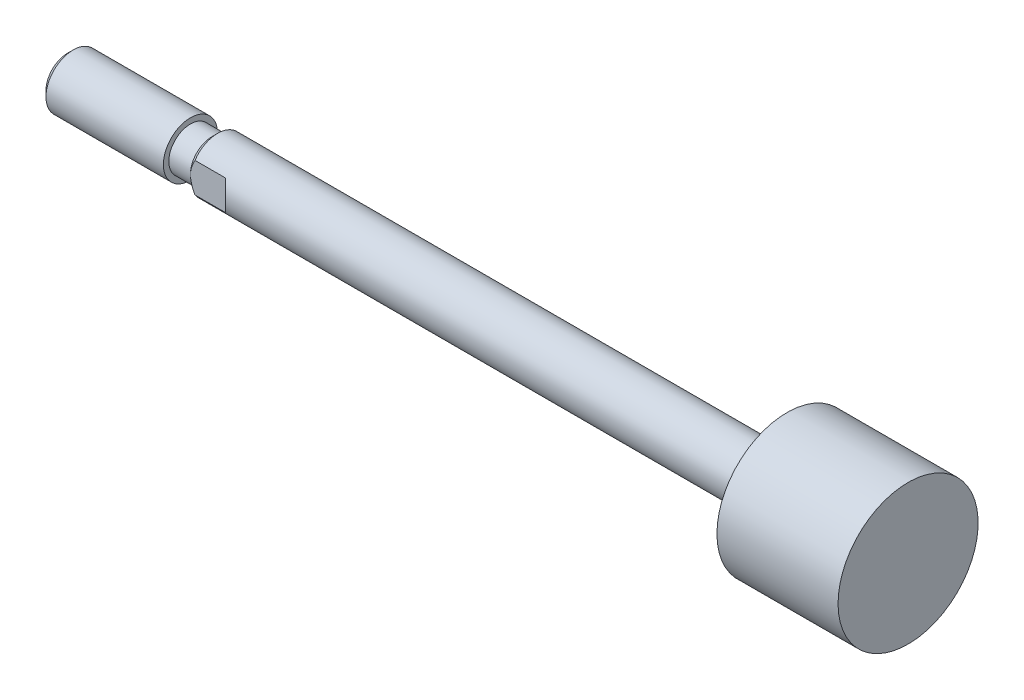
ISO-10303-21;
HEADER;
FILE_DESCRIPTION(('STEP AP214'),'2;1');
FILE_NAME('part.step','',(''),(''),'','','');
FILE_SCHEMA(('AUTOMOTIVE_DESIGN { 1 0 10303 214 1 1 1 1 }'));
ENDSEC;
DATA;
#1=APPLICATION_CONTEXT('core data for automotive mechanical design processes');
#2=APPLICATION_PROTOCOL_DEFINITION('international standard','automotive_design',2000,#1);
#3=PRODUCT_CONTEXT('',#1,'mechanical');
#4=PRODUCT('Part','Part','',(#3));
#5=PRODUCT_RELATED_PRODUCT_CATEGORY('part','',(#4));
#6=PRODUCT_DEFINITION_FORMATION('','',#4);
#7=PRODUCT_DEFINITION_CONTEXT('part definition',#1,'design');
#8=PRODUCT_DEFINITION('design','',#6,#7);
#9=PRODUCT_DEFINITION_SHAPE('','',#8);
#10=(LENGTH_UNIT() NAMED_UNIT(*) SI_UNIT(.MILLI.,.METRE.));
#11=(NAMED_UNIT(*) PLANE_ANGLE_UNIT() SI_UNIT($,.RADIAN.));
#12=(NAMED_UNIT(*) SI_UNIT($,.STERADIAN.) SOLID_ANGLE_UNIT());
#13=UNCERTAINTY_MEASURE_WITH_UNIT(LENGTH_MEASURE(1.E-05),#10,'distance_accuracy_value','');
#14=(GEOMETRIC_REPRESENTATION_CONTEXT(3) GLOBAL_UNCERTAINTY_ASSIGNED_CONTEXT((#13)) GLOBAL_UNIT_ASSIGNED_CONTEXT((#10,
#11,#12)) REPRESENTATION_CONTEXT('',''));
#15=CARTESIAN_POINT('',(0.,0.,0.));
#16=DIRECTION('',(0.,0.,1.));
#17=DIRECTION('',(1.,0.,0.));
#18=AXIS2_PLACEMENT_3D('',#15,#16,#17);
#19=CARTESIAN_POINT('',(-38.,0.,0.));
#20=DIRECTION('',(1.,0.,0.));
#21=DIRECTION('',(0.,0.,-1.));
#22=AXIS2_PLACEMENT_3D('',#19,#20,#21);
#23=PLANE('',#22);
#24=CARTESIAN_POINT('',(-38.,0.,0.));
#25=DIRECTION('',(-1.,0.,0.));
#26=DIRECTION('',(0.,0.,1.));
#27=AXIS2_PLACEMENT_3D('',#24,#25,#26);
#28=CIRCLE('',#27,2.3865);
#29=CARTESIAN_POINT('',(-38.,0.,2.3865));
#30=VERTEX_POINT('',#29);
#31=EDGE_CURVE('E60',#30,#30,#28,.T.);
#32=ORIENTED_EDGE('',*,*,#31,.T.);
#33=EDGE_LOOP('',(#32));
#34=FACE_BOUND('',#33,.T.);
#35=ADVANCED_FACE('F16',(#34),#23,.F.);
#36=CARTESIAN_POINT('',(-37.3865,0.,0.));
#37=DIRECTION('',(1.,0.,0.));
#38=DIRECTION('',(0.,0.,-1.));
#39=AXIS2_PLACEMENT_3D('',#36,#37,#38);
#40=CONICAL_SURFACE('',#39,3.,0.785398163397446);
#41=ORIENTED_EDGE('',*,*,#31,.F.);
#42=EDGE_LOOP('',(#41));
#43=FACE_BOUND('',#42,.T.);
#44=CARTESIAN_POINT('',(-37.3865,0.,0.));
#45=DIRECTION('',(-1.,0.,0.));
#46=DIRECTION('',(0.,0.,1.));
#47=AXIS2_PLACEMENT_3D('',#44,#45,#46);
#48=CIRCLE('',#47,3.);
#49=CARTESIAN_POINT('',(-37.3865,0.,3.));
#50=VERTEX_POINT('',#49);
#51=EDGE_CURVE('E142',#50,#50,#48,.T.);
#52=ORIENTED_EDGE('',*,*,#51,.T.);
#53=EDGE_LOOP('',(#52));
#54=FACE_BOUND('',#53,.T.);
#55=ADVANCED_FACE('F131',(#43,#54),#40,.T.);
#56=CARTESIAN_POINT('',(55.,0.,0.));
#57=DIRECTION('',(-1.,0.,0.));
#58=DIRECTION('',(0.,0.,1.));
#59=AXIS2_PLACEMENT_3D('',#56,#57,#58);
#60=CYLINDRICAL_SURFACE('',#59,3.);
#61=ORIENTED_EDGE('',*,*,#51,.F.);
#62=EDGE_LOOP('',(#61));
#63=FACE_BOUND('',#62,.T.);
#64=CARTESIAN_POINT('',(-24.4,0.,0.));
#65=DIRECTION('',(-1.,0.,0.));
#66=DIRECTION('',(0.,0.,1.));
#67=AXIS2_PLACEMENT_3D('',#64,#65,#66);
#68=CIRCLE('',#67,3.);
#69=CARTESIAN_POINT('',(-24.4,0.,3.));
#70=VERTEX_POINT('',#69);
#71=EDGE_CURVE('E144',#70,#70,#68,.T.);
#72=ORIENTED_EDGE('',*,*,#71,.T.);
#73=EDGE_LOOP('',(#72));
#74=FACE_BOUND('',#73,.T.);
#75=ADVANCED_FACE('F138',(#63,#74),#60,.T.);
#76=CARTESIAN_POINT('',(-24.4,3.,0.));
#77=DIRECTION('',(-1.,0.,0.));
#78=DIRECTION('',(0.,0.,1.));
#79=AXIS2_PLACEMENT_3D('',#76,#77,#78);
#80=PLANE('',#79);
#81=ORIENTED_EDGE('',*,*,#71,.F.);
#82=EDGE_LOOP('',(#81));
#83=FACE_BOUND('',#82,.T.);
#84=CARTESIAN_POINT('',(-24.4,0.,0.));
#85=DIRECTION('',(-1.,0.,0.));
#86=DIRECTION('',(0.,0.,1.));
#87=AXIS2_PLACEMENT_3D('',#84,#85,#86);
#88=CIRCLE('',#87,2.4);
#89=CARTESIAN_POINT('',(-24.4,0.,2.4));
#90=VERTEX_POINT('',#89);
#91=EDGE_CURVE('E149',#90,#90,#88,.T.);
#92=ORIENTED_EDGE('',*,*,#91,.T.);
#93=EDGE_LOOP('',(#92));
#94=FACE_BOUND('',#93,.T.);
#95=ADVANCED_FACE('F222',(#83,#94),#80,.F.);
#96=CARTESIAN_POINT('',(55.,0.,0.));
#97=DIRECTION('',(-1.,0.,0.));
#98=DIRECTION('',(0.,0.,1.));
#99=AXIS2_PLACEMENT_3D('',#96,#97,#98);
#100=CYLINDRICAL_SURFACE('',#99,2.4);
#101=ORIENTED_EDGE('',*,*,#91,.F.);
#102=EDGE_LOOP('',(#101));
#103=FACE_BOUND('',#102,.T.);
#104=CARTESIAN_POINT('',(-22.,0.,0.));
#105=DIRECTION('',(-1.,0.,0.));
#106=DIRECTION('',(0.,0.,1.));
#107=AXIS2_PLACEMENT_3D('',#104,#105,#106);
#108=CIRCLE('',#107,2.4);
#109=CARTESIAN_POINT('',(-22.,0.,2.4));
#110=VERTEX_POINT('',#109);
#111=EDGE_CURVE('E152',#110,#110,#108,.T.);
#112=ORIENTED_EDGE('',*,*,#111,.T.);
#113=EDGE_LOOP('',(#112));
#114=FACE_BOUND('',#113,.T.);
#115=ADVANCED_FACE('F128',(#103,#114),#100,.T.);
#116=CARTESIAN_POINT('',(-21.4,0.,0.));
#117=DIRECTION('',(1.,0.,0.));
#118=DIRECTION('',(0.,0.,-1.));
#119=AXIS2_PLACEMENT_3D('',#116,#117,#118);
#120=CONICAL_SURFACE('',#119,3.,0.785398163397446);
#121=ORIENTED_EDGE('',*,*,#111,.F.);
#122=EDGE_LOOP('',(#121));
#123=FACE_BOUND('',#122,.T.);
#124=CARTESIAN_POINT('',(-21.4,0.,0.));
#125=DIRECTION('',(-1.,0.,0.));
#126=DIRECTION('',(0.,0.,1.));
#127=AXIS2_PLACEMENT_3D('',#124,#125,#126);
#128=CIRCLE('',#127,3.);
#129=CARTESIAN_POINT('',(-21.4,1.6583123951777,2.5));
#130=VERTEX_POINT('',#129);
#131=CARTESIAN_POINT('',(-21.4,1.6583123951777,-2.5));
#132=VERTEX_POINT('',#131);
#133=EDGE_CURVE('E72',#130,#132,#128,.T.);
#134=ORIENTED_EDGE('',*,*,#133,.T.);
#135=CARTESIAN_POINT('',(-18.9252289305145,-4.87063838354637,-2.5));
#136=CARTESIAN_POINT('',(-19.0253991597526,-4.75802584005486,-2.5));
#137=CARTESIAN_POINT('',(-19.1251834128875,-4.64506665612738,-2.5));
#138=CARTESIAN_POINT('',(-19.3237736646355,-4.41827100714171,-2.5));
#139=CARTESIAN_POINT('',(-19.4225795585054,-4.30443445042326,-2.5));
#140=CARTESIAN_POINT('',(-19.619410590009,-4.07522880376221,-2.5));
#141=CARTESIAN_POINT('',(-19.7174304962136,-3.95985521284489,-2.5));
#142=CARTESIAN_POINT('',(-19.911936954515,-3.7278298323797,-2.5));
#143=CARTESIAN_POINT('',(-20.0084235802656,-3.61117810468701,-2.5));
#144=CARTESIAN_POINT('',(-20.205215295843,-3.36919546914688,-2.5));
#145=CARTESIAN_POINT('',(-20.3053992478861,-3.24376574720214,-2.5));
#146=CARTESIAN_POINT('',(-20.5028637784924,-2.99064359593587,-2.5));
#147=CARTESIAN_POINT('',(-20.6001445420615,-2.86295131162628,-2.5));
#148=CARTESIAN_POINT('',(-20.790600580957,-2.60486889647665,-2.5));
#149=CARTESIAN_POINT('',(-20.883782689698,-2.47448383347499,-2.5));
#150=CARTESIAN_POINT('',(-21.0646406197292,-2.2099695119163,-2.5));
#151=CARTESIAN_POINT('',(-21.1523184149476,-2.07584162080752,-2.5));
#152=CARTESIAN_POINT('',(-21.2944077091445,-1.84400231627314,-2.5));
#153=CARTESIAN_POINT('',(-21.3508595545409,-1.74754764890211,-2.5));
#154=CARTESIAN_POINT('',(-21.4586890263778,-1.55177170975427,-2.5));
#155=CARTESIAN_POINT('',(-21.5100650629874,-1.45244955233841,-2.5));
#156=CARTESIAN_POINT('',(-21.6056568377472,-1.25143988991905,-2.5));
#157=CARTESIAN_POINT('',(-21.6499310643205,-1.14978053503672,-2.5));
#158=CARTESIAN_POINT('',(-21.7297330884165,-0.943074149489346,-2.5));
#159=CARTESIAN_POINT('',(-21.7652664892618,-0.838029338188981,-2.5));
#160=CARTESIAN_POINT('',(-21.8156258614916,-0.65868151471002,-2.5));
#161=CARTESIAN_POINT('',(-21.833443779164,-0.585220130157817,-2.5));
#162=CARTESIAN_POINT('',(-21.8631135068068,-0.437094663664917,-2.5));
#163=CARTESIAN_POINT('',(-21.8749663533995,-0.362430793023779,-2.5));
#164=CARTESIAN_POINT('',(-21.8920761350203,-0.212600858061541,-2.5));
#165=CARTESIAN_POINT('',(-21.8973556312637,-0.137437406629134,-2.5));
#166=CARTESIAN_POINT('',(-21.9010977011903,0.0130627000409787,-2.5));
#167=CARTESIAN_POINT('',(-21.8995602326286,0.08839935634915,-2.5));
#168=CARTESIAN_POINT('',(-21.8897818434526,0.238239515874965,-2.5));
#169=CARTESIAN_POINT('',(-21.8815754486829,0.312745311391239,-2.5));
#170=CARTESIAN_POINT('',(-21.8589397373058,0.460809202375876,-2.5));
#171=CARTESIAN_POINT('',(-21.8445089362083,0.534367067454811,-2.5));
#172=CARTESIAN_POINT('',(-21.8099050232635,0.6809750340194,-2.5));
#173=CARTESIAN_POINT('',(-21.7896692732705,0.754010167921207,-2.5));
#174=CARTESIAN_POINT('',(-21.7443224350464,0.89851618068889,-2.5));
#175=CARTESIAN_POINT('',(-21.7192122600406,0.969987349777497,-2.5));
#176=CARTESIAN_POINT('',(-21.6555480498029,1.13565578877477,-2.5));
#177=CARTESIAN_POINT('',(-21.6153405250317,1.22921487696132,-2.5));
#178=CARTESIAN_POINT('',(-21.5291522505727,1.41365514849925,-2.5));
#179=CARTESIAN_POINT('',(-21.4831682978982,1.50453481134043,-2.5));
#180=CARTESIAN_POINT('',(-21.3865638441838,1.68420740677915,-2.5));
#181=CARTESIAN_POINT('',(-21.3359269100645,1.77299143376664,-2.5));
#182=CARTESIAN_POINT('',(-21.2311708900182,1.94844240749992,-2.5));
#183=CARTESIAN_POINT('',(-21.1770524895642,2.03510976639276,-2.5));
#184=CARTESIAN_POINT('',(-21.068851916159,2.20236354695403,-2.5));
#185=CARTESIAN_POINT('',(-21.0149037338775,2.28303710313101,-2.5));
#186=CARTESIAN_POINT('',(-20.9050097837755,2.44301727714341,-2.5));
#187=CARTESIAN_POINT('',(-20.849063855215,2.5223237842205,-2.5));
#188=CARTESIAN_POINT('',(-20.7360576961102,2.67906748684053,-2.5));
#189=CARTESIAN_POINT('',(-20.6790117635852,2.75651502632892,-2.5));
#190=CARTESIAN_POINT('',(-20.5636130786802,2.91039941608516,-2.5));
#191=CARTESIAN_POINT('',(-20.5052606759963,2.98683652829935,-2.5));
#192=CARTESIAN_POINT('',(-20.4463811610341,3.06285845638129,-2.5));
#193=B_SPLINE_CURVE_WITH_KNOTS('',3,(#135,#136,#137,#138,#139,#140,#141,#142,#143,#144,#145,
#146,#147,#148,#149,#150,#151,#152,#153,#154,#155,#156,#157,#158,#159,#160,#161,#162,#163,#164,
#165,#166,#167,#168,#169,#170,#171,#172,#173,#174,#175,#176,#177,#178,#179,#180,#181,#182,#183,
#184,#185,#186,#187,#188,#189,#190,#191,#192),.UNSPECIFIED.,.F.,.F.,(4,2,2,2,2,2,2,2,2,2,2,2,2,
2,2,2,2,2,2,2,2,2,2,2,2,2,2,2,4),(0.,0.452154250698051,0.904356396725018,1.3585160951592,
1.81265391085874,2.29420857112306,2.77573247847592,3.25642052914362,3.73693520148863,
4.07210288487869,4.40737521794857,4.73972626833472,5.07186370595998,5.29842779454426,
5.52495249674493,5.75069755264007,5.97644400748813,6.20102913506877,6.42566785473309,
6.65282810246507,6.87994583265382,7.1851778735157,7.49057991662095,7.79710536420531,
8.10357064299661,8.39468383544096,8.68582050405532,8.97437306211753,9.26284928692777),.UNSPECIFIED.);
#194=CARTESIAN_POINT('',(-21.4,-1.6583123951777,-2.5));
#195=VERTEX_POINT('',#194);
#196=EDGE_CURVE('E84',#132,#195,#193,.F.);
#197=ORIENTED_EDGE('',*,*,#196,.T.);
#198=CARTESIAN_POINT('',(-21.4,-1.65831239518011,2.5));
#199=VERTEX_POINT('',#198);
#200=EDGE_CURVE('E156',#195,#199,#128,.T.);
#201=ORIENTED_EDGE('',*,*,#200,.T.);
#202=CARTESIAN_POINT('',(-18.9252289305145,-4.87063838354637,2.5));
#203=CARTESIAN_POINT('',(-19.0253991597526,-4.75802584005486,2.5));
#204=CARTESIAN_POINT('',(-19.1251834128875,-4.64506665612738,2.5));
#205=CARTESIAN_POINT('',(-19.3237736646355,-4.41827100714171,2.5));
#206=CARTESIAN_POINT('',(-19.4225795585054,-4.30443445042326,2.5));
#207=CARTESIAN_POINT('',(-19.619410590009,-4.07522880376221,2.5));
#208=CARTESIAN_POINT('',(-19.7174304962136,-3.95985521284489,2.5));
#209=CARTESIAN_POINT('',(-19.911936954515,-3.7278298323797,2.5));
#210=CARTESIAN_POINT('',(-20.0084235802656,-3.61117810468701,2.5));
#211=CARTESIAN_POINT('',(-20.205215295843,-3.36919546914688,2.5));
#212=CARTESIAN_POINT('',(-20.3053992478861,-3.24376574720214,2.5));
#213=CARTESIAN_POINT('',(-20.5028637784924,-2.99064359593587,2.5));
#214=CARTESIAN_POINT('',(-20.6001445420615,-2.86295131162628,2.5));
#215=CARTESIAN_POINT('',(-20.790600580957,-2.60486889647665,2.5));
#216=CARTESIAN_POINT('',(-20.883782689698,-2.47448383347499,2.5));
#217=CARTESIAN_POINT('',(-21.0646406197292,-2.2099695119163,2.5));
#218=CARTESIAN_POINT('',(-21.1523184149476,-2.07584162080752,2.5));
#219=CARTESIAN_POINT('',(-21.2944077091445,-1.84400231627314,2.5));
#220=CARTESIAN_POINT('',(-21.3508595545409,-1.74754764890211,2.5));
#221=CARTESIAN_POINT('',(-21.4586890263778,-1.55177170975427,2.5));
#222=CARTESIAN_POINT('',(-21.5100650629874,-1.45244955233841,2.5));
#223=CARTESIAN_POINT('',(-21.6056568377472,-1.25143988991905,2.5));
#224=CARTESIAN_POINT('',(-21.6499310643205,-1.14978053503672,2.5));
#225=CARTESIAN_POINT('',(-21.7297330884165,-0.943074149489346,2.5));
#226=CARTESIAN_POINT('',(-21.7652664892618,-0.838029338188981,2.5));
#227=CARTESIAN_POINT('',(-21.8156258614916,-0.65868151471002,2.5));
#228=CARTESIAN_POINT('',(-21.833443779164,-0.585220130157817,2.5));
#229=CARTESIAN_POINT('',(-21.8631135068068,-0.437094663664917,2.5));
#230=CARTESIAN_POINT('',(-21.8749663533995,-0.362430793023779,2.5));
#231=CARTESIAN_POINT('',(-21.8920761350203,-0.212600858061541,2.5));
#232=CARTESIAN_POINT('',(-21.8973556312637,-0.137437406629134,2.5));
#233=CARTESIAN_POINT('',(-21.9010977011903,0.0130627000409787,2.5));
#234=CARTESIAN_POINT('',(-21.8995602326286,0.08839935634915,2.5));
#235=CARTESIAN_POINT('',(-21.8897818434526,0.238239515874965,2.5));
#236=CARTESIAN_POINT('',(-21.8815754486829,0.312745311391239,2.5));
#237=CARTESIAN_POINT('',(-21.8589397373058,0.460809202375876,2.5));
#238=CARTESIAN_POINT('',(-21.8445089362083,0.534367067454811,2.5));
#239=CARTESIAN_POINT('',(-21.8099050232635,0.6809750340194,2.5));
#240=CARTESIAN_POINT('',(-21.7896692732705,0.754010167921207,2.5));
#241=CARTESIAN_POINT('',(-21.7443224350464,0.89851618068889,2.5));
#242=CARTESIAN_POINT('',(-21.7192122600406,0.969987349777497,2.5));
#243=CARTESIAN_POINT('',(-21.6555480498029,1.13565578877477,2.5));
#244=CARTESIAN_POINT('',(-21.6153405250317,1.22921487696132,2.5));
#245=CARTESIAN_POINT('',(-21.5291522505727,1.41365514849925,2.5));
#246=CARTESIAN_POINT('',(-21.4831682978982,1.50453481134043,2.5));
#247=CARTESIAN_POINT('',(-21.3865638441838,1.68420740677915,2.5));
#248=CARTESIAN_POINT('',(-21.3359269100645,1.77299143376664,2.5));
#249=CARTESIAN_POINT('',(-21.2311708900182,1.94844240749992,2.5));
#250=CARTESIAN_POINT('',(-21.1770524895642,2.03510976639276,2.5));
#251=CARTESIAN_POINT('',(-21.068851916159,2.20236354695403,2.5));
#252=CARTESIAN_POINT('',(-21.0149037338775,2.28303710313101,2.5));
#253=CARTESIAN_POINT('',(-20.9050097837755,2.44301727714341,2.5));
#254=CARTESIAN_POINT('',(-20.849063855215,2.5223237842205,2.5));
#255=CARTESIAN_POINT('',(-20.7360576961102,2.67906748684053,2.5));
#256=CARTESIAN_POINT('',(-20.6790117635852,2.75651502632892,2.5));
#257=CARTESIAN_POINT('',(-20.5636130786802,2.91039941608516,2.5));
#258=CARTESIAN_POINT('',(-20.5052606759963,2.98683652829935,2.5));
#259=CARTESIAN_POINT('',(-20.4463811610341,3.06285845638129,2.5));
#260=B_SPLINE_CURVE_WITH_KNOTS('',3,(#202,#203,#204,#205,#206,#207,#208,#209,#210,#211,#212,
#213,#214,#215,#216,#217,#218,#219,#220,#221,#222,#223,#224,#225,#226,#227,#228,#229,#230,#231,
#232,#233,#234,#235,#236,#237,#238,#239,#240,#241,#242,#243,#244,#245,#246,#247,#248,#249,#250,
#251,#252,#253,#254,#255,#256,#257,#258,#259),.UNSPECIFIED.,.F.,.F.,(4,2,2,2,2,2,2,2,2,2,2,2,2,
2,2,2,2,2,2,2,2,2,2,2,2,2,2,2,4),(0.,0.452154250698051,0.904356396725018,1.3585160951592,
1.81265391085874,2.29420857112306,2.77573247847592,3.25642052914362,3.73693520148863,
4.07210288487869,4.40737521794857,4.73972626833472,5.07186370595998,5.29842779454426,
5.52495249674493,5.75069755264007,5.97644400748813,6.20102913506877,6.42566785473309,
6.65282810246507,6.87994583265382,7.1851778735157,7.49057991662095,7.79710536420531,
8.10357064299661,8.39468383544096,8.68582050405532,8.97437306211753,9.26284928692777),.UNSPECIFIED.);
#261=EDGE_CURVE('E82',#199,#130,#260,.T.);
#262=ORIENTED_EDGE('',*,*,#261,.T.);
#263=EDGE_LOOP('',(#134,#197,#201,#262));
#264=FACE_BOUND('',#263,.T.);
#265=ADVANCED_FACE('F99',(#123,#264),#120,.T.);
#266=CARTESIAN_POINT('',(55.,0.,0.));
#267=DIRECTION('',(-1.,0.,0.));
#268=DIRECTION('',(0.,0.,1.));
#269=AXIS2_PLACEMENT_3D('',#266,#267,#268);
#270=CYLINDRICAL_SURFACE('',#269,3.);
#271=CARTESIAN_POINT('',(-20.5,0.,0.));
#272=DIRECTION('',(0.707106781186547,0.,0.707106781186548));
#273=DIRECTION('',(-0.707106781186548,0.,0.707106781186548));
#274=AXIS2_PLACEMENT_3D('',#271,#272,#273);
#275=ELLIPSE('',#274,4.24264068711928,3.);
#276=CARTESIAN_POINT('',(-18.,-1.6583123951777,-2.5));
#277=VERTEX_POINT('',#276);
#278=CARTESIAN_POINT('',(-18.,1.6583123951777,-2.5));
#279=VERTEX_POINT('',#278);
#280=EDGE_CURVE('E23',#277,#279,#275,.T.);
#281=ORIENTED_EDGE('',*,*,#280,.T.);
#282=DIRECTION('',(-1.,0.,0.));
#283=VECTOR('',#282,1.);
#284=CARTESIAN_POINT('',(55.,1.6583123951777,-2.5));
#285=LINE('',#284,#283);
#286=EDGE_CURVE('E11',#279,#132,#285,.T.);
#287=ORIENTED_EDGE('',*,*,#286,.T.);
#288=ORIENTED_EDGE('',*,*,#133,.F.);
#289=DIRECTION('',(-1.,0.,0.));
#290=VECTOR('',#289,1.);
#291=CARTESIAN_POINT('',(55.,1.6583123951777,2.5));
#292=LINE('',#291,#290);
#293=CARTESIAN_POINT('',(-18.,1.65831239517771,2.5));
#294=VERTEX_POINT('',#293);
#295=EDGE_CURVE('E59',#130,#294,#292,.F.);
#296=ORIENTED_EDGE('',*,*,#295,.T.);
#297=CARTESIAN_POINT('',(-20.5,0.,0.));
#298=DIRECTION('',(0.707106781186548,0.,-0.707106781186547));
#299=DIRECTION('',(-0.707106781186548,0.,-0.707106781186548));
#300=AXIS2_PLACEMENT_3D('',#297,#298,#299);
#301=ELLIPSE('',#300,4.24264068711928,3.);
#302=CARTESIAN_POINT('',(-18.,-1.65831239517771,2.5));
#303=VERTEX_POINT('',#302);
#304=EDGE_CURVE('E54',#294,#303,#301,.T.);
#305=ORIENTED_EDGE('',*,*,#304,.T.);
#306=DIRECTION('',(-1.,0.,0.));
#307=VECTOR('',#306,1.);
#308=CARTESIAN_POINT('',(55.,-1.6583123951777,2.5));
#309=LINE('',#308,#307);
#310=EDGE_CURVE('E65',#303,#199,#309,.T.);
#311=ORIENTED_EDGE('',*,*,#310,.T.);
#312=ORIENTED_EDGE('',*,*,#200,.F.);
#313=DIRECTION('',(-1.,0.,0.));
#314=VECTOR('',#313,1.);
#315=CARTESIAN_POINT('',(55.,-1.6583123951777,-2.5));
#316=LINE('',#315,#314);
#317=EDGE_CURVE('E74',#195,#277,#316,.F.);
#318=ORIENTED_EDGE('',*,*,#317,.T.);
#319=EDGE_LOOP('',(#281,#287,#288,#296,#305,#311,#312,#318));
#320=FACE_BOUND('',#319,.T.);
#321=CARTESIAN_POINT('',(41.6,0.,0.));
#322=DIRECTION('',(-1.,0.,0.));
#323=DIRECTION('',(0.,0.,1.));
#324=AXIS2_PLACEMENT_3D('',#321,#322,#323);
#325=CIRCLE('',#324,3.);
#326=CARTESIAN_POINT('',(41.6,0.,3.));
#327=VERTEX_POINT('',#326);
#328=EDGE_CURVE('E157',#327,#327,#325,.T.);
#329=ORIENTED_EDGE('',*,*,#328,.T.);
#330=EDGE_LOOP('',(#329));
#331=FACE_BOUND('',#330,.T.);
#332=ADVANCED_FACE('F69',(#320,#331),#270,.T.);
#333=CARTESIAN_POINT('',(41.6,3.,0.));
#334=DIRECTION('',(1.,0.,0.));
#335=DIRECTION('',(0.,0.,-1.));
#336=AXIS2_PLACEMENT_3D('',#333,#334,#335);
#337=PLANE('',#336);
#338=ORIENTED_EDGE('',*,*,#328,.F.);
#339=EDGE_LOOP('',(#338));
#340=FACE_BOUND('',#339,.T.);
#341=CARTESIAN_POINT('',(41.6,0.,0.));
#342=DIRECTION('',(-1.,0.,0.));
#343=DIRECTION('',(0.,0.,1.));
#344=AXIS2_PLACEMENT_3D('',#341,#342,#343);
#345=CIRCLE('',#344,7.75);
#346=CARTESIAN_POINT('',(41.6,0.,7.75));
#347=VERTEX_POINT('',#346);
#348=EDGE_CURVE('E160',#347,#347,#345,.T.);
#349=ORIENTED_EDGE('',*,*,#348,.T.);
#350=EDGE_LOOP('',(#349));
#351=FACE_BOUND('',#350,.T.);
#352=ADVANCED_FACE('F118',(#340,#351),#337,.F.);
#353=CARTESIAN_POINT('',(55.,0.,0.));
#354=DIRECTION('',(-1.,0.,0.));
#355=DIRECTION('',(0.,0.,1.));
#356=AXIS2_PLACEMENT_3D('',#353,#354,#355);
#357=CYLINDRICAL_SURFACE('',#356,7.75);
#358=ORIENTED_EDGE('',*,*,#348,.F.);
#359=EDGE_LOOP('',(#358));
#360=FACE_BOUND('',#359,.T.);
#361=CARTESIAN_POINT('',(55.,0.,0.));
#362=DIRECTION('',(-1.,0.,0.));
#363=DIRECTION('',(0.,0.,1.));
#364=AXIS2_PLACEMENT_3D('',#361,#362,#363);
#365=CIRCLE('',#364,7.75);
#366=CARTESIAN_POINT('',(55.,0.,7.75));
#367=VERTEX_POINT('',#366);
#368=EDGE_CURVE('E162',#367,#367,#365,.T.);
#369=ORIENTED_EDGE('',*,*,#368,.T.);
#370=EDGE_LOOP('',(#369));
#371=FACE_BOUND('',#370,.T.);
#372=ADVANCED_FACE('F114',(#360,#371),#357,.T.);
#373=CARTESIAN_POINT('',(55.,7.75,0.));
#374=DIRECTION('',(-1.,0.,0.));
#375=DIRECTION('',(0.,0.,1.));
#376=AXIS2_PLACEMENT_3D('',#373,#374,#375);
#377=PLANE('',#376);
#378=ORIENTED_EDGE('',*,*,#368,.F.);
#379=EDGE_LOOP('',(#378));
#380=FACE_BOUND('',#379,.T.);
#381=ADVANCED_FACE('F111',(#380),#377,.F.);
#382=CARTESIAN_POINT('',(-13.,-6.,7.5));
#383=DIRECTION('',(0.707106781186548,0.,-0.707106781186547));
#384=DIRECTION('',(-0.707106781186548,0.,-0.707106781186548));
#385=AXIS2_PLACEMENT_3D('',#382,#383,#384);
#386=PLANE('',#385);
#387=DIRECTION('',(0.,1.,0.));
#388=VECTOR('',#387,1.);
#389=CARTESIAN_POINT('',(-18.,-6.,2.5));
#390=LINE('',#389,#388);
#391=EDGE_CURVE('E37',#303,#294,#390,.T.);
#392=ORIENTED_EDGE('',*,*,#391,.F.);
#393=ORIENTED_EDGE('',*,*,#304,.F.);
#394=EDGE_LOOP('',(#392,#393));
#395=FACE_BOUND('',#394,.T.);
#396=ADVANCED_FACE('F55',(#395),#386,.F.);
#397=CARTESIAN_POINT('',(-18.,-6.,2.5));
#398=DIRECTION('',(0.,0.,-1.));
#399=DIRECTION('',(-1.,0.,0.));
#400=AXIS2_PLACEMENT_3D('',#397,#398,#399);
#401=PLANE('',#400);
#402=ORIENTED_EDGE('',*,*,#391,.T.);
#403=ORIENTED_EDGE('',*,*,#295,.F.);
#404=ORIENTED_EDGE('',*,*,#261,.F.);
#405=ORIENTED_EDGE('',*,*,#310,.F.);
#406=EDGE_LOOP('',(#402,#403,#404,#405));
#407=FACE_BOUND('',#406,.T.);
#408=ADVANCED_FACE('F63',(#407),#401,.F.);
#409=CARTESIAN_POINT('',(-18.,-6.,-2.5));
#410=DIRECTION('',(0.707106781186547,0.,0.707106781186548));
#411=DIRECTION('',(0.707106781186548,0.,-0.707106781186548));
#412=AXIS2_PLACEMENT_3D('',#409,#410,#411);
#413=PLANE('',#412);
#414=DIRECTION('',(0.,1.,0.));
#415=VECTOR('',#414,1.);
#416=CARTESIAN_POINT('',(-18.,-6.,-2.5));
#417=LINE('',#416,#415);
#418=EDGE_CURVE('E30',#277,#279,#417,.T.);
#419=ORIENTED_EDGE('',*,*,#418,.T.);
#420=ORIENTED_EDGE('',*,*,#280,.F.);
#421=EDGE_LOOP('',(#419,#420));
#422=FACE_BOUND('',#421,.T.);
#423=ADVANCED_FACE('F81',(#422),#413,.F.);
#424=CARTESIAN_POINT('',(-22.,-6.,-2.5));
#425=DIRECTION('',(0.,0.,1.));
#426=DIRECTION('',(1.,0.,0.));
#427=AXIS2_PLACEMENT_3D('',#424,#425,#426);
#428=PLANE('',#427);
#429=ORIENTED_EDGE('',*,*,#418,.F.);
#430=ORIENTED_EDGE('',*,*,#317,.F.);
#431=ORIENTED_EDGE('',*,*,#196,.F.);
#432=ORIENTED_EDGE('',*,*,#286,.F.);
#433=EDGE_LOOP('',(#429,#430,#431,#432));
#434=FACE_BOUND('',#433,.T.);
#435=ADVANCED_FACE('F106',(#434),#428,.F.);
#436=CLOSED_SHELL('',(#35,#55,#75,#95,#115,#265,#332,#352,#372,#381,#396,#408,#423,#435));
#437=MANIFOLD_SOLID_BREP('B1',#436);
#438=ADVANCED_BREP_SHAPE_REPRESENTATION('',(#18,#437),#14);
#439=SHAPE_DEFINITION_REPRESENTATION(#9,#438);
ENDSEC;
END-ISO-10303-21;
